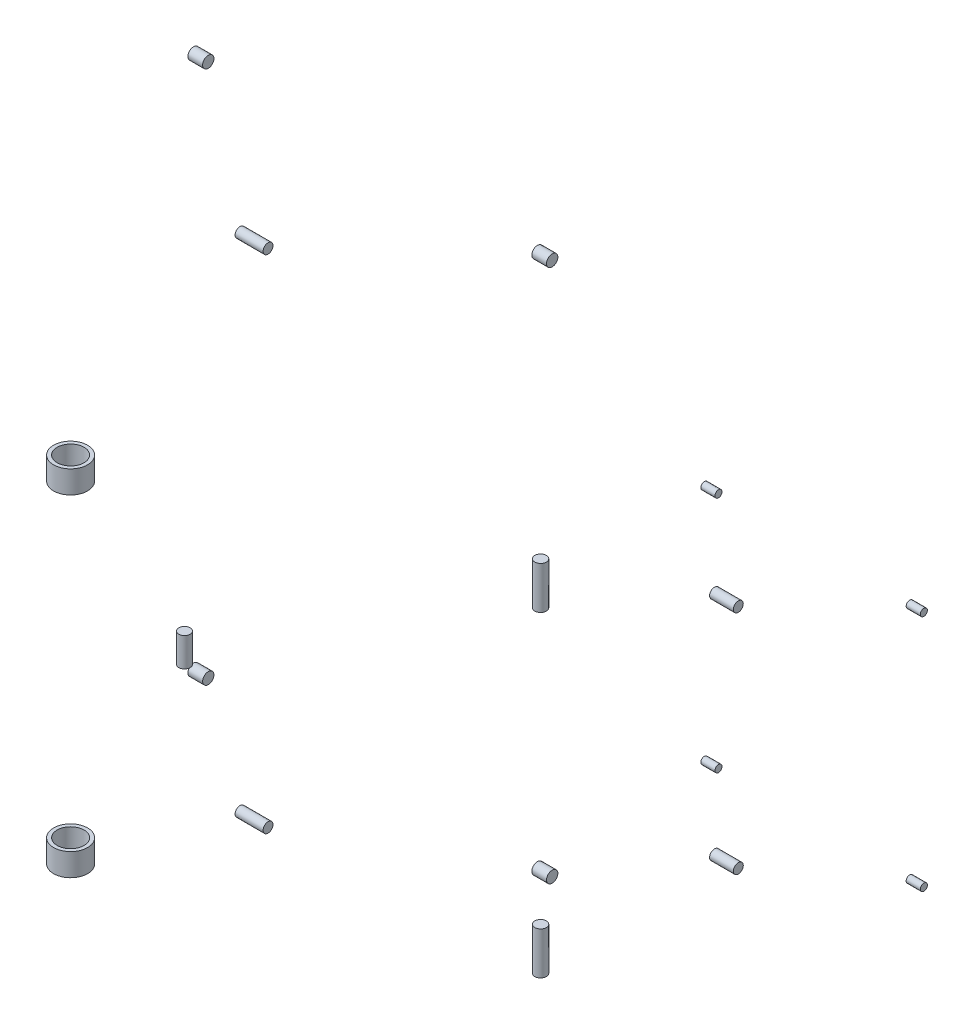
from build123d import *

# Parameters (mm, degrees)
ESQUISSE7_R          = 12.5
BOSS_EXTRU_4_DEPTH   = 50
BOSS_EXTRU_4_2_DEPTH = 50
ESQUISSE8_R          = 12.5
BOSS_EXTRU_5_DEPTH   = 50
BOSS_EXTRU_5_2_DEPTH = 50
ESQUISSE9_R          = 17.5
BOSS_EXTRU_6_DEPTH   = 84
BOSS_EXTRU_6_2_DEPTH = 84
ESQUISSE10_R         = 20
BOSS_EXTRU_7_DEPTH   = 52
BOSS_EXTRU_7_2_DEPTH = 52
ESQUISSE11_R         = 20
BOSS_EXTRU_8_DEPTH   = 52
BOSS_EXTRU_8_2_DEPTH = 52
ESQUISSE12_R         = 17.5
BOSS_EXTRU_9_DEPTH   = 99
BOSS_EXTRU_9_2_DEPTH = 99
ESQUISSE13_R         = 20.5
BOSS_EXTRU_10_DEPTH  = 150
ESQUISSE14_R         = 20.5
BOSS_EXTRU_11_DEPTH  = 150
ESQUISSE15_R         = 20
BOSS_EXTRU_12_DEPTH  = 102
ESQUISSE16_R         = 60
ESQUISSE16_R_2       = 47.5
BOSS_EXTRU_13_DEPTH  = 80
ESQUISSE17_R         = 60
ESQUISSE17_R_2       = 47.5
BOSS_EXTRU_14_DEPTH  = 80


with BuildPart() as part:
    # Esquisse7 → Boss.-Extru.4 (new body)
    with BuildSketch(Plane(origin=(1660, 420, 1200), x_dir=(0, 0, -1), z_dir=(1, 0, 0))):
        Circle(ESQUISSE7_R)
    extrude(amount=-BOSS_EXTRU_4_DEPTH)


with BuildPart() as body_2:
    # Esquisse7 → Boss.-Extru.4 2 (new body)
    with BuildSketch(Plane(origin=(1660, 420, 1200), x_dir=(0, 0, -1), z_dir=(1, 0, 0))):
        with Locations((0, -840)):
            Circle(ESQUISSE7_R)
    extrude(amount=-BOSS_EXTRU_4_2_DEPTH)


with BuildPart() as body_3:
    # Esquisse8 → Boss.-Extru.5 (new body)
    with BuildSketch(Plane(origin=(885, -420, 1200), x_dir=(0, 0, 1), z_dir=(-1, 0, 0))):
        Circle(ESQUISSE8_R)
    extrude(amount=-BOSS_EXTRU_5_DEPTH)


with BuildPart() as body_4:
    # Esquisse8 → Boss.-Extru.5 2 (new body)
    with BuildSketch(Plane(origin=(885, -420, 1200), x_dir=(0, 0, 1), z_dir=(-1, 0, 0))):
        with Locations((0, 840)):
            Circle(ESQUISSE8_R)
    extrude(amount=-BOSS_EXTRU_5_2_DEPTH)


with BuildPart() as body_5:
    # Esquisse9 → Boss.-Extru.6 (new body)
    with BuildSketch(Plane(origin=(1295, 400, 1490), x_dir=(0, 0, 1), z_dir=(-1, 0, 0))):
        with Locations(Location((0, 0, 0), (0, 0, 180))):
            Circle(ESQUISSE9_R)
    extrude(amount=BOSS_EXTRU_6_DEPTH)


with BuildPart() as body_6:
    # Esquisse9 → Boss.-Extru.6 2 (new body)
    with BuildSketch(Plane(origin=(1295, 400, 1490), x_dir=(0, 0, 1), z_dir=(-1, 0, 0))):
        with Locations(Location((0, -800, 0), (0, 0, 180))):
            Circle(ESQUISSE9_R)
    extrude(amount=BOSS_EXTRU_6_2_DEPTH)


with BuildPart() as body_7:
    # Esquisse10 → Boss.-Extru.7 (new body)
    with BuildSketch(Plane(origin=(450, -942, 1302), x_dir=(0, 0, 1), z_dir=(-1, 0, 0))):
        with Locations(Location((0, 0, 0), (0, 0, 180))):
            Circle(ESQUISSE10_R)
    extrude(amount=BOSS_EXTRU_7_DEPTH)


with BuildPart() as body_8:
    # Esquisse10 → Boss.-Extru.7 2 (new body)
    with BuildSketch(Plane(origin=(450, -942, 1302), x_dir=(0, 0, 1), z_dir=(-1, 0, 0))):
        with Locations(Location((0, 1884, 0), (0, 0, 180))):
            Circle(ESQUISSE10_R)
    extrude(amount=BOSS_EXTRU_7_2_DEPTH)


with BuildPart() as body_9:
    # Esquisse11 → Boss.-Extru.8 (new body)
    with BuildSketch(Plane(origin=(-816.000123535, -942, 1302), x_dir=(0, 0, 1), z_dir=(-1, 0, 0))):
        Circle(ESQUISSE11_R)
    extrude(amount=-BOSS_EXTRU_8_DEPTH)


with BuildPart() as body_10:
    # Esquisse11 → Boss.-Extru.8 2 (new body)
    with BuildSketch(Plane(origin=(-816.000123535, -942, 1302), x_dir=(0, 0, 1), z_dir=(-1, 0, 0))):
        with Locations((0, 1884)):
            Circle(ESQUISSE11_R)
    extrude(amount=-BOSS_EXTRU_8_2_DEPTH)


with BuildPart() as body_11:
    # Esquisse12 → Boss.-Extru.9 (new body)
    with BuildSketch(Plane(origin=(-244, -885, 1710), x_dir=(0, 0, 1), z_dir=(-1, 0, 0))):
        Circle(ESQUISSE12_R)
    extrude(amount=-BOSS_EXTRU_9_DEPTH)


with BuildPart() as body_12:
    # Esquisse12 → Boss.-Extru.9 2 (new body)
    with BuildSketch(Plane(origin=(-244, -885, 1710), x_dir=(0, 0, 1), z_dir=(-1, 0, 0))):
        with Locations((0, 1770)):
            Circle(ESQUISSE12_R)
    extrude(amount=-BOSS_EXTRU_9_2_DEPTH)


with BuildPart() as body_13:
    # Esquisse13 → Boss.-Extru.10 (new body)
    with BuildSketch(Plane(origin=(1033, -633.841980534, 1926), x_dir=(1, 0, 0), z_dir=(0, 1, 0))):
        with Locations(Location((0, 0, 0), (0, 0, 270))):
            Circle(ESQUISSE13_R)
    extrude(amount=BOSS_EXTRU_10_DEPTH)


with BuildPart() as body_14:
    # Esquisse14 → Boss.-Extru.11 (new body)
    with BuildSketch(Plane(origin=(1033, 633.475221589, 1926), x_dir=(1, 0, 0), z_dir=(0, 1, 0))):
        with Locations(Location((0, 0, 0), (0, 0, 270))):
            Circle(ESQUISSE14_R)
    extrude(amount=-BOSS_EXTRU_11_DEPTH)


with BuildPart() as body_15:
    # Esquisse15 → Boss.-Extru.12 (new body)
    with BuildSketch(Plane(origin=(380, 286, 2530), x_dir=(1, 0, 0), z_dir=(0, 1, 0))):
        with Locations(Location((0, 0, 0), (0, 0, 270))):
            Circle(ESQUISSE15_R)
    extrude(amount=BOSS_EXTRU_12_DEPTH)


with BuildPart() as body_16:
    # Esquisse16 → Boss.-Extru.13 (new body)
    with BuildSketch(Plane(origin=(-122, -625, 2430), x_dir=(1, 0, 0), z_dir=(0, 1, 0))):
        with Locations(Location((0, 0, 0), (0, 0, 270))):
            Circle(ESQUISSE16_R)
        with Locations(Location((0, 0, 0), (0, 0, 270))):
            Circle(ESQUISSE16_R_2, mode=Mode.SUBTRACT)
    extrude(amount=BOSS_EXTRU_13_DEPTH)


with BuildPart() as body_17:
    # Esquisse17 → Boss.-Extru.14 (new body)
    with BuildSketch(Plane(origin=(-122, 625, 2430), x_dir=(1, 0, 0), z_dir=(0, 1, 0))):
        with Locations(Location((0, 0, 0), (0, 0, 270))):
            Circle(ESQUISSE17_R)
        with Locations(Location((0, 0, 0), (0, 0, 270))):
            Circle(ESQUISSE17_R_2, mode=Mode.SUBTRACT)
    extrude(amount=-BOSS_EXTRU_14_DEPTH)


solid = Compound([part.part, body_2.part, body_3.part, body_4.part, body_5.part, body_6.part, body_7.part, body_8.part, body_9.part, body_10.part, body_11.part, body_12.part, body_13.part, body_14.part, body_15.part, body_16.part, body_17.part])
